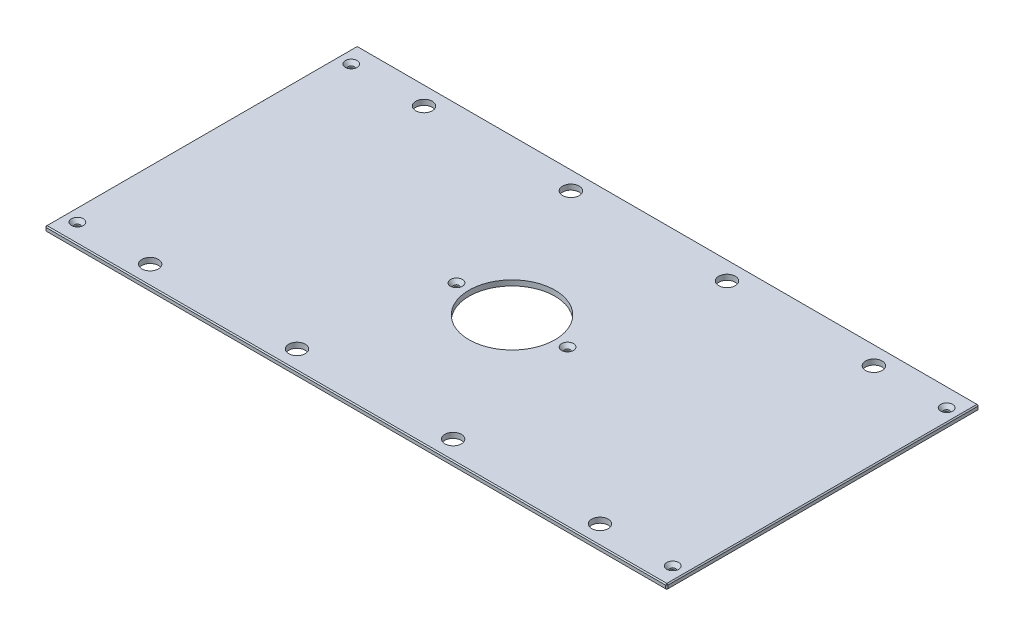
from build123d import *

# Parameters (mm, degrees)
SKETCH1_W                                     = 746.125
SKETCH1_H                                     = 374.65
BOSS_EXTRUDE1_DEPTH                           = 6.35
SKETCH13_R                                    = 51.562
CUT_EXTRUDE6_DEPTH                            = 418.500427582
F_25_32_0_78125_DIAMETER_HOLE1_D              = 19.84375
CHAMFER2_SIZE                                 = 1.27
CSK_FOR_1_4_FLAT_HEAD_MACHINE_SCREW1_AT_COUNT = 2
CSK_FOR_1_4_FLAT_HEAD_MACHINE_SCREW1_AT_PITCH = 328.60996
CSK_FOR_1_4_FLAT_HEAD_MACHINE_SCREW1_2_COUNT  = 2
CSK_FOR_1_4_FLAT_HEAD_MACHINE_SCREW1_2_PITCH  = 786.330812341
CSK_FOR_1_4_FLAT_HEAD_MACHINE_SCREW1_3_COUNT  = 2
CSK_FOR_1_4_FLAT_HEAD_MACHINE_SCREW1_3_PITCH  = 454.593824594
CSK_FOR_1_4_FLAT_HEAD_MACHINE_SCREW1_4_COUNT  = 2
CSK_FOR_1_4_FLAT_HEAD_MACHINE_SCREW1_4_PITCH  = 333.756856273
CSK_FOR_1_4_FLAT_HEAD_MACHINE_SCREW1_5_COUNT  = 2
CSK_FOR_1_4_FLAT_HEAD_MACHINE_SCREW1_5_PITCH  = 714.375
CSK_FOR_1_4_FLAT_HEAD_MACHINE_SCREW1_6_COUNT  = 2
CSK_FOR_1_4_FLAT_HEAD_MACHINE_SCREW1_6_PITCH  = 627.0625
CSK_FOR_1_4_FLAT_HEAD_MACHINE_SCREW1_7_COUNT  = 2
CSK_FOR_1_4_FLAT_HEAD_MACHINE_SCREW1_7_PITCH  = 707.949069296


with BuildPart() as part:
    # Sketch1 → Boss-Extrude1 (new body)
    with BuildSketch(Plane(origin=(0, 0, 0), x_dir=(1, 0, 0), z_dir=(0, 1, 0))):
        Rectangle(SKETCH1_W, SKETCH1_H)
    extrude(amount=BOSS_EXTRUDE1_DEPTH)

    # Sketch13 → Cut-Extrude6 (cut, through all)
    with BuildSketch(Plane(origin=(0, 6.35, 0), x_dir=(1, 0, 0), z_dir=(0, 1, 0))):
        with Locations(Location((0, 0, 0), (0, 0, 270))):
            Circle(SKETCH13_R)
    extrude(amount=-CUT_EXTRUDE6_DEPTH, mode=Mode.SUBTRACT)

    # 25_32 _0.78125_ Diameter Hole1 (through all)
    with Locations(Plane(origin=(0, 6.35, 0), x_dir=(1, 0, 0), z_dir=(0, 1, 0))):
        with Locations((269.875, 164.30498), (-269.875, 164.30498), (269.875, -164.30498), (-269.875, -164.30498), (-93.6625, 164.30498), (93.6625, 164.30498), (93.6625, -164.30498), (-93.6625, -164.30498)):
            Hole(F_25_32_0_78125_DIAMETER_HOLE1_D / 2)

    # Chamfer2
    chamfer2_edges = [part.edges().sort_by_distance(p)[0] for p in [
        (373.0625, 6.35, 0),
        (0, 6.35, -187.325),
        (-373.0625, 6.35, 0),
        (0, 0, -187.325),
        (373.0625, 0, 0),
        (0, 0, 187.325),
        (-373.0625, 0, 0),
        (0, 6.35, 187.325),
        (-373.0625, 3.175, -187.325),
        (373.0625, 3.175, -187.325),
        (373.0625, 3.175, 187.325),
        (-373.0625, 3.175, 187.325),
    ]]
    chamfer(chamfer2_edges, length=CHAMFER2_SIZE)

    # Sketch24 → CSK for 1_4 Flat Head Machine Screw1 (revolve, cut)
    with BuildSketch(Plane(origin=(357.1875, 6.35, -164.30498), x_dir=(0, 0, 1), z_dir=(1, 0, 0))):
        Polygon((0, 0), (0, 6.35), (3.3782, 6.35), (3.3782, 4.324464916), (7.1374, 0), align=None)
    csk_for_1_4_flat_head_machine_screw1 = revolve(axis=Axis((357.1875, 12.7, -164.30498), (0, -1, 0)), mode=Mode.SUBTRACT)

    # CSK for 1_4 Flat Head Machine Screw1 at: CSK for 1_4 Flat Head Machine Screw1 ×2
    with Locations(*[(0, 0, i * CSK_FOR_1_4_FLAT_HEAD_MACHINE_SCREW1_AT_PITCH) for i in range(1, CSK_FOR_1_4_FLAT_HEAD_MACHINE_SCREW1_AT_COUNT)]):
        add(csk_for_1_4_flat_head_machine_screw1, mode=Mode.SUBTRACT)

    # CSK for 1_4 Flat Head Machine Screw1 2: CSK for 1_4 Flat Head Machine Screw1 ×2
    with Locations(*[Vector(-0.9084916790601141, 0, 0.41790294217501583) * (i * CSK_FOR_1_4_FLAT_HEAD_MACHINE_SCREW1_2_PITCH) for i in range(1, CSK_FOR_1_4_FLAT_HEAD_MACHINE_SCREW1_2_COUNT)]):
        add(csk_for_1_4_flat_head_machine_screw1, mode=Mode.SUBTRACT)

    # CSK for 1_4 Flat Head Machine Screw1 3: CSK for 1_4 Flat Head Machine Screw1 ×2
    with Locations(*[Vector(-0.9323982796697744, 0, 0.36143249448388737) * (i * CSK_FOR_1_4_FLAT_HEAD_MACHINE_SCREW1_3_PITCH) for i in range(1, CSK_FOR_1_4_FLAT_HEAD_MACHINE_SCREW1_3_COUNT)]):
        add(csk_for_1_4_flat_head_machine_screw1, mode=Mode.SUBTRACT)

    # CSK for 1_4 Flat Head Machine Screw1 4: CSK for 1_4 Flat Head Machine Screw1 ×2
    with Locations(*[Vector(-0.8704315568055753, 0, 0.4922894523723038) * (i * CSK_FOR_1_4_FLAT_HEAD_MACHINE_SCREW1_4_PITCH) for i in range(1, CSK_FOR_1_4_FLAT_HEAD_MACHINE_SCREW1_4_COUNT)]):
        add(csk_for_1_4_flat_head_machine_screw1, mode=Mode.SUBTRACT)

    # CSK for 1_4 Flat Head Machine Screw1 5: CSK for 1_4 Flat Head Machine Screw1 ×2
    with Locations(*[(-i * CSK_FOR_1_4_FLAT_HEAD_MACHINE_SCREW1_5_PITCH, 0, 0) for i in range(1, CSK_FOR_1_4_FLAT_HEAD_MACHINE_SCREW1_5_COUNT)]):
        add(csk_for_1_4_flat_head_machine_screw1, mode=Mode.SUBTRACT)

    # CSK for 1_4 Flat Head Machine Screw1 6: CSK for 1_4 Flat Head Machine Screw1 ×2
    with Locations(*[(-i * CSK_FOR_1_4_FLAT_HEAD_MACHINE_SCREW1_6_PITCH, 0, 0) for i in range(1, CSK_FOR_1_4_FLAT_HEAD_MACHINE_SCREW1_6_COUNT)]):
        add(csk_for_1_4_flat_head_machine_screw1, mode=Mode.SUBTRACT)

    # CSK for 1_4 Flat Head Machine Screw1 7: CSK for 1_4 Flat Head Machine Screw1 ×2
    with Locations(*[Vector(-0.8857452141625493, 0, 0.46417175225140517) * (i * CSK_FOR_1_4_FLAT_HEAD_MACHINE_SCREW1_7_PITCH) for i in range(1, CSK_FOR_1_4_FLAT_HEAD_MACHINE_SCREW1_7_COUNT)]):
        add(csk_for_1_4_flat_head_machine_screw1, mode=Mode.SUBTRACT)


solid = part.part
